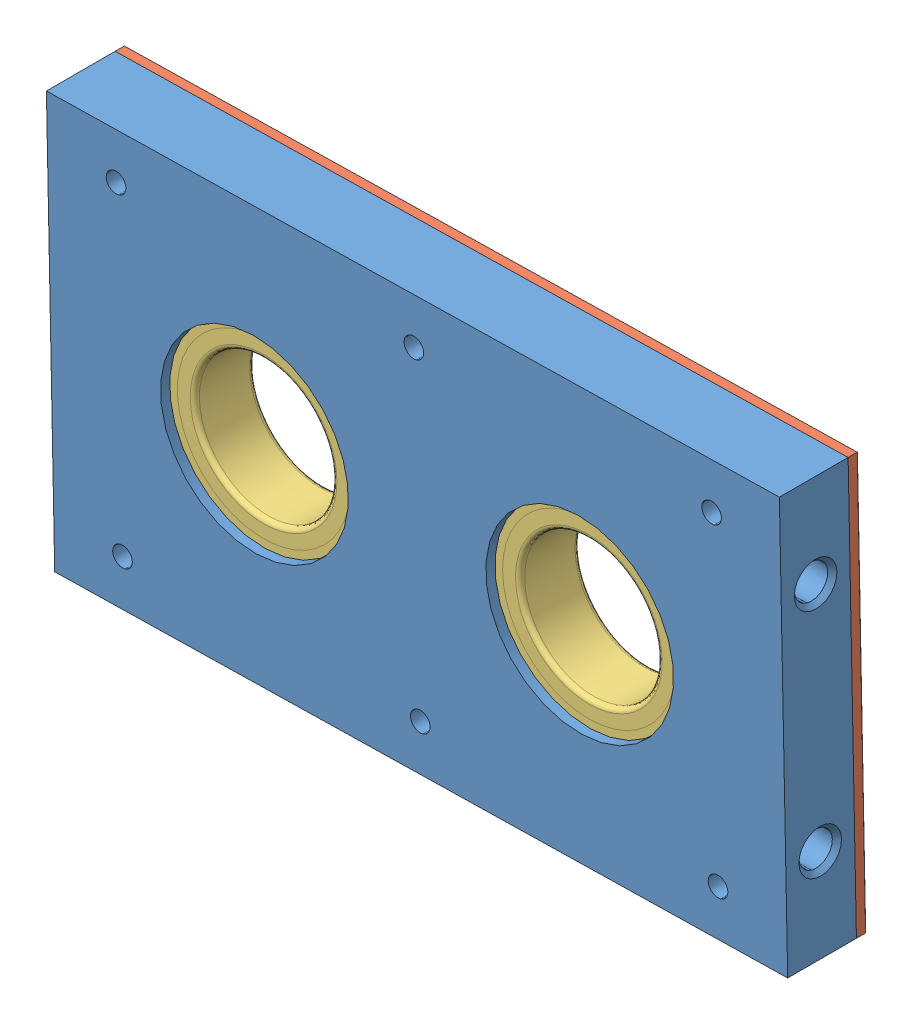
SolidWorks assembly bearing assembly.SLDASM, configuration Default (file format 5000). Lengths in mm.
Overall size (161.78 93.2 20.75).
10 component instances, 4 part files, 9 mates.
Components (placement in the parent):
- printed bearing holder-4: printed bearing holder.SLDPRT [Default] at (-110.7579 98.2865 -150.0906) x (0.999798 0.020112 0) z (0.020112 -0.999798 0) size (160 15 90)
- printed bearing holder thin-2: printed bearing holder thin.SLDPRT [Default] at (-270.7256 95.0686 -137.0906) x (-0.999798 -0.020112 0) z (0.020112 -0.999798 0) size (160 3 90)
- skf 6006 30x55x13-1: skf 6006 30x55x13.SLDPRT [Default] at (-227.1396 140.9545 -137.0906) x (0 0 -1) z (0.997594 -0.069334 0) size (13 55 55)
- skf 6006 30x55x13-2: skf 6006 30x55x13.SLDPRT [Default] at (-156.154 142.3824 -150.0906) x (0 0 1) z (-0.908645 -0.417569 0) size (13 55 55)
- socket button head screw_iso-1: socket button head screw_iso.sldprt [ISO 7380 - M5 x 12 --- 12S] at (-127.3639 177.9687 -155.8406) x (0 0 1) z (-1 0 0) size (14.75 9.5 9.5)
- socket button head screw_iso-2: socket button head screw_iso.sldprt [ISO 7380 - M5 x 12 --- 12S] at (-125.956 107.9828 -155.8406) x (0 0 1) z (-1 0 0) size (14.75 9.5 9.5)
- socket button head screw_iso-3: socket button head screw_iso.sldprt [ISO 7380 - M5 x 12 --- 12S] at (-192.3507 176.6614 -155.8406) x (0 0 1) z (-1 0 0) size (14.75 9.5 9.5)
- socket button head screw_iso-4: socket button head screw_iso.sldprt [ISO 7380 - M5 x 12 --- 12S] at (-190.9429 106.6755 -155.8406) x (0 0 1) z (-1 0 0) size (14.75 9.5 9.5)
- socket button head screw_iso-5: socket button head screw_iso.sldprt [ISO 7380 - M5 x 12 --- 12S] at (-257.3376 175.3541 -155.8406) x (0 0 1) z (-1 0 0) size (14.75 9.5 9.5)
- socket button head screw_iso-6: socket button head screw_iso.sldprt [ISO 7380 - M5 x 12 --- 12S] at (-255.9297 105.3682 -155.8406) x (0 0 1) z (-1 0 0) size (14.75 9.5 9.5)
Mates (geometry in assembly coordinates):
- Coincident31: coincident anti-aligned: plane of printed bearing holder-4 through (-110.7579 98.2865 -150.0906) normal (0 0 -1); plane of printed bearing holder thin-2 through (-110.7579 98.2865 -150.0906) normal (0 0 1)
- Coincident32: coincident aligned: plane of printed bearing holder-4 through (-110.7579 98.2865 -137.0906) normal (0.020112 -0.999798 0); plane of printed bearing holder thin-2 through (-270.7256 95.0686 -151.0906) normal (0.020112 -0.999798 0)
- Coincident33: coincident aligned: plane of printed bearing holder-4 through (-270.7256 95.0686 -137.0906) normal (-0.999798 -0.020112 0); plane of printed bearing holder thin-2 through (-270.7256 95.0686 -151.0906) normal (-0.999798 -0.020112 0)
- Coincident36: coincident anti-aligned: plane of printed bearing holder thin-2 through (-110.7579 98.2865 -150.0906) normal (0 0 1); plane of skf 6006 30x55x13-1 through (-227.1396 140.9545 -150.0906) normal (0 0 -1)
- Concentric13: concentric anti-aligned: cylinder of printed bearing holder-4 through (-227.1396 140.9545 -137.0906) axis (0 0 -1) radius 27.55; cylinder of skf 6006 30x55x13-1 through (-227.1396 140.9545 -150.0906) axis (0 0 1) radius 27.5
- Coincident37: coincident anti-aligned: plane of printed bearing holder thin-2 through (-110.7579 98.2865 -150.0906) normal (0 0 1); plane of skf 6006 30x55x13-2 through (-156.154 142.3824 -150.0906) normal (0 0 -1)
- Concentric14: concentric aligned: cylinder of printed bearing holder-4 through (-156.154 142.3824 -137.0906) axis (0 0 -1) radius 27.55; cylinder of skf 6006 30x55x13-2 through (-156.154 142.3824 -137.0906) axis (0 0 -1) radius 27.5
- Coincident38: coincident anti-aligned: plane of printed bearing holder thin-2 through (-270.7256 95.0686 -153.0906) normal (0 0 -1); plane of socket button head screw_iso-1 through (-127.3639 180.4687 -153.0906) normal (0 0 1)
- Concentric15: concentric aligned: cylinder of printed bearing holder thin-2 through (-127.3639 177.9687 -142.0906) axis (0 0 -1) radius 2.65; circle of socket button head screw_iso-1
